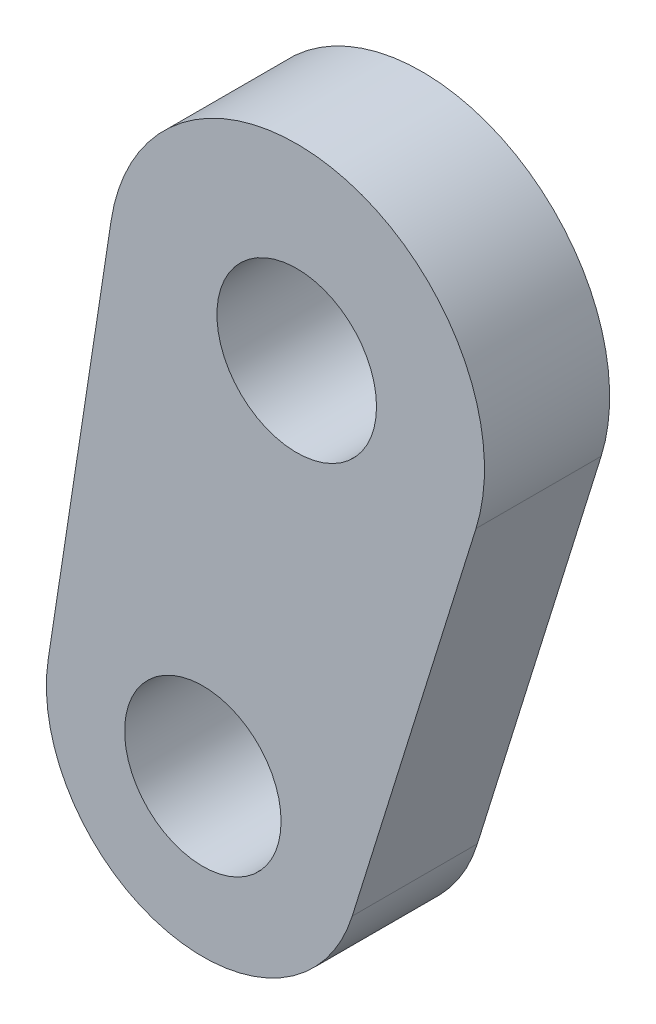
ISO-10303-21;
HEADER;
FILE_DESCRIPTION(('STEP AP214'),'2;1');
FILE_NAME('part.step','',(''),(''),'','','');
FILE_SCHEMA(('AUTOMOTIVE_DESIGN { 1 0 10303 214 1 1 1 1 }'));
ENDSEC;
DATA;
#1=APPLICATION_CONTEXT('core data for automotive mechanical design processes');
#2=APPLICATION_PROTOCOL_DEFINITION('international standard','automotive_design',2000,#1);
#3=PRODUCT_CONTEXT('',#1,'mechanical');
#4=PRODUCT('Part','Part','',(#3));
#5=PRODUCT_RELATED_PRODUCT_CATEGORY('part','',(#4));
#6=PRODUCT_DEFINITION_FORMATION('','',#4);
#7=PRODUCT_DEFINITION_CONTEXT('part definition',#1,'design');
#8=PRODUCT_DEFINITION('design','',#6,#7);
#9=PRODUCT_DEFINITION_SHAPE('','',#8);
#10=(LENGTH_UNIT() NAMED_UNIT(*) SI_UNIT(.MILLI.,.METRE.));
#11=(NAMED_UNIT(*) PLANE_ANGLE_UNIT() SI_UNIT($,.RADIAN.));
#12=(NAMED_UNIT(*) SI_UNIT($,.STERADIAN.) SOLID_ANGLE_UNIT());
#13=UNCERTAINTY_MEASURE_WITH_UNIT(LENGTH_MEASURE(1.E-05),#10,'distance_accuracy_value','');
#14=(GEOMETRIC_REPRESENTATION_CONTEXT(3) GLOBAL_UNCERTAINTY_ASSIGNED_CONTEXT((#13)) GLOBAL_UNIT_ASSIGNED_CONTEXT((#10,
#11,#12)) REPRESENTATION_CONTEXT('',''));
#15=CARTESIAN_POINT('',(0.,0.,0.));
#16=DIRECTION('',(0.,0.,1.));
#17=DIRECTION('',(1.,0.,0.));
#18=AXIS2_PLACEMENT_3D('',#15,#16,#17);
#19=CARTESIAN_POINT('',(-6.,-26.,52.4));
#20=DIRECTION('',(0.,0.,1.));
#21=DIRECTION('',(1.,0.,0.));
#22=AXIS2_PLACEMENT_3D('',#19,#20,#21);
#23=PLANE('',#22);
#24=CARTESIAN_POINT('',(0.,0.,52.4));
#25=DIRECTION('',(0.,0.,1.));
#26=DIRECTION('',(1.,0.,0.));
#27=AXIS2_PLACEMENT_3D('',#24,#25,#26);
#28=CIRCLE('',#27,5.1);
#29=CARTESIAN_POINT('',(5.1,0.,52.4));
#30=VERTEX_POINT('',#29);
#31=EDGE_CURVE('E102',#30,#30,#28,.T.);
#32=ORIENTED_EDGE('',*,*,#31,.F.);
#33=EDGE_LOOP('',(#32));
#34=FACE_BOUND('',#33,.T.);
#35=CARTESIAN_POINT('',(-6.,-26.,52.4));
#36=DIRECTION('',(0.,0.,1.));
#37=DIRECTION('',(1.,0.,0.));
#38=AXIS2_PLACEMENT_3D('',#35,#36,#37);
#39=CIRCLE('',#38,10.);
#40=CARTESIAN_POINT('',(-15.8850421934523,-24.4880671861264,52.4));
#41=VERTEX_POINT('',#40);
#42=CARTESIAN_POINT('',(3.5479635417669,-28.972606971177,52.4));
#43=VERTEX_POINT('',#42);
#44=EDGE_CURVE('E87',#41,#43,#39,.T.);
#45=ORIENTED_EDGE('',*,*,#44,.T.);
#46=DIRECTION('',(0.297260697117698,0.95479635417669,0.));
#47=VECTOR('',#46,1.);
#48=CARTESIAN_POINT('',(3.5479635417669,-28.972606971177,52.4));
#49=LINE('',#48,#47);
#50=CARTESIAN_POINT('',(11.4575562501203,-3.56712836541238,52.4));
#51=VERTEX_POINT('',#50);
#52=EDGE_CURVE('E82',#43,#51,#49,.T.);
#53=ORIENTED_EDGE('',*,*,#52,.T.);
#54=CARTESIAN_POINT('',(0.,0.,52.4));
#55=DIRECTION('',(0.,0.,1.));
#56=DIRECTION('',(1.,0.,0.));
#57=AXIS2_PLACEMENT_3D('',#54,#55,#56);
#58=CIRCLE('',#57,12.);
#59=CARTESIAN_POINT('',(-11.8620506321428,1.81431937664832,52.4));
#60=VERTEX_POINT('',#59);
#61=EDGE_CURVE('E85',#51,#60,#58,.T.);
#62=ORIENTED_EDGE('',*,*,#61,.T.);
#63=DIRECTION('',(-0.151193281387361,-0.98850421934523,0.));
#64=VECTOR('',#63,1.);
#65=CARTESIAN_POINT('',(-11.8620506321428,1.81431937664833,52.4));
#66=LINE('',#65,#64);
#67=EDGE_CURVE('E52',#60,#41,#66,.T.);
#68=ORIENTED_EDGE('',*,*,#67,.T.);
#69=EDGE_LOOP('',(#45,#53,#62,#68));
#70=FACE_BOUND('',#69,.T.);
#71=CARTESIAN_POINT('',(-6.,-26.,52.4));
#72=DIRECTION('',(0.,0.,1.));
#73=DIRECTION('',(1.,0.,0.));
#74=AXIS2_PLACEMENT_3D('',#71,#72,#73);
#75=CIRCLE('',#74,5.);
#76=CARTESIAN_POINT('',(-1.,-26.,52.4));
#77=VERTEX_POINT('',#76);
#78=EDGE_CURVE('E117',#77,#77,#75,.T.);
#79=ORIENTED_EDGE('',*,*,#78,.F.);
#80=EDGE_LOOP('',(#79));
#81=FACE_BOUND('',#80,.T.);
#82=ADVANCED_FACE('F35',(#34,#70,#81),#23,.T.);
#83=CARTESIAN_POINT('',(-6.,-26.,44.4));
#84=DIRECTION('',(0.,0.,1.));
#85=DIRECTION('',(1.,0.,0.));
#86=AXIS2_PLACEMENT_3D('',#83,#84,#85);
#87=PLANE('',#86);
#88=CARTESIAN_POINT('',(-6.,-26.,44.4));
#89=DIRECTION('',(0.,0.,1.));
#90=DIRECTION('',(1.,0.,0.));
#91=AXIS2_PLACEMENT_3D('',#88,#89,#90);
#92=CIRCLE('',#91,10.);
#93=CARTESIAN_POINT('',(-15.8850421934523,-24.4880671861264,44.4));
#94=VERTEX_POINT('',#93);
#95=CARTESIAN_POINT('',(3.5479635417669,-28.972606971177,44.4));
#96=VERTEX_POINT('',#95);
#97=EDGE_CURVE('E99',#94,#96,#92,.T.);
#98=ORIENTED_EDGE('',*,*,#97,.F.);
#99=DIRECTION('',(-0.151193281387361,-0.98850421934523,0.));
#100=VECTOR('',#99,1.);
#101=CARTESIAN_POINT('',(-11.8620506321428,1.81431937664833,44.4));
#102=LINE('',#101,#100);
#103=CARTESIAN_POINT('',(-11.8620506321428,1.81431937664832,44.4));
#104=VERTEX_POINT('',#103);
#105=EDGE_CURVE('E75',#104,#94,#102,.T.);
#106=ORIENTED_EDGE('',*,*,#105,.F.);
#107=CARTESIAN_POINT('',(0.,0.,44.4));
#108=DIRECTION('',(0.,0.,1.));
#109=DIRECTION('',(1.,0.,0.));
#110=AXIS2_PLACEMENT_3D('',#107,#108,#109);
#111=CIRCLE('',#110,12.);
#112=CARTESIAN_POINT('',(11.4575562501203,-3.56712836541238,44.4));
#113=VERTEX_POINT('',#112);
#114=EDGE_CURVE('E69',#113,#104,#111,.T.);
#115=ORIENTED_EDGE('',*,*,#114,.F.);
#116=DIRECTION('',(0.297260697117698,0.95479635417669,0.));
#117=VECTOR('',#116,1.);
#118=CARTESIAN_POINT('',(3.5479635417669,-28.972606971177,44.4));
#119=LINE('',#118,#117);
#120=EDGE_CURVE('E91',#96,#113,#119,.T.);
#121=ORIENTED_EDGE('',*,*,#120,.F.);
#122=EDGE_LOOP('',(#98,#106,#115,#121));
#123=FACE_BOUND('',#122,.T.);
#124=CARTESIAN_POINT('',(0.,0.,44.4));
#125=DIRECTION('',(0.,0.,1.));
#126=DIRECTION('',(1.,0.,0.));
#127=AXIS2_PLACEMENT_3D('',#124,#125,#126);
#128=CIRCLE('',#127,5.1);
#129=CARTESIAN_POINT('',(5.1,0.,44.4));
#130=VERTEX_POINT('',#129);
#131=EDGE_CURVE('E114',#130,#130,#128,.T.);
#132=ORIENTED_EDGE('',*,*,#131,.T.);
#133=EDGE_LOOP('',(#132));
#134=FACE_BOUND('',#133,.T.);
#135=CARTESIAN_POINT('',(-6.,-26.,44.4));
#136=DIRECTION('',(0.,0.,1.));
#137=DIRECTION('',(1.,0.,0.));
#138=AXIS2_PLACEMENT_3D('',#135,#136,#137);
#139=CIRCLE('',#138,5.);
#140=CARTESIAN_POINT('',(-1.,-26.,44.4));
#141=VERTEX_POINT('',#140);
#142=EDGE_CURVE('E120',#141,#141,#139,.T.);
#143=ORIENTED_EDGE('',*,*,#142,.T.);
#144=EDGE_LOOP('',(#143));
#145=FACE_BOUND('',#144,.T.);
#146=ADVANCED_FACE('F110',(#123,#134,#145),#87,.F.);
#147=CARTESIAN_POINT('',(-6.,-26.,52.4));
#148=DIRECTION('',(0.,0.,-1.));
#149=DIRECTION('',(-1.,0.,0.));
#150=AXIS2_PLACEMENT_3D('',#147,#148,#149);
#151=CYLINDRICAL_SURFACE('',#150,10.);
#152=ORIENTED_EDGE('',*,*,#97,.T.);
#153=DIRECTION('',(0.,0.,-1.));
#154=VECTOR('',#153,1.);
#155=CARTESIAN_POINT('',(3.5479635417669,-28.972606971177,52.4));
#156=LINE('',#155,#154);
#157=EDGE_CURVE('E11',#43,#96,#156,.T.);
#158=ORIENTED_EDGE('',*,*,#157,.F.);
#159=ORIENTED_EDGE('',*,*,#44,.F.);
#160=DIRECTION('',(0.,0.,-1.));
#161=VECTOR('',#160,1.);
#162=CARTESIAN_POINT('',(-15.8850421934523,-24.4880671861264,52.4));
#163=LINE('',#162,#161);
#164=EDGE_CURVE('E95',#41,#94,#163,.T.);
#165=ORIENTED_EDGE('',*,*,#164,.T.);
#166=EDGE_LOOP('',(#152,#158,#159,#165));
#167=FACE_BOUND('',#166,.T.);
#168=ADVANCED_FACE('F37',(#167),#151,.T.);
#169=CARTESIAN_POINT('',(3.5479635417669,-28.972606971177,52.4));
#170=DIRECTION('',(-0.954796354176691,0.297260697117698,0.));
#171=DIRECTION('',(-0.297260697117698,-0.954796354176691,0.));
#172=AXIS2_PLACEMENT_3D('',#169,#170,#171);
#173=PLANE('',#172);
#174=ORIENTED_EDGE('',*,*,#120,.T.);
#175=DIRECTION('',(0.,0.,-1.));
#176=VECTOR('',#175,1.);
#177=CARTESIAN_POINT('',(11.4575562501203,-3.56712836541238,52.4));
#178=LINE('',#177,#176);
#179=EDGE_CURVE('E44',#51,#113,#178,.T.);
#180=ORIENTED_EDGE('',*,*,#179,.F.);
#181=ORIENTED_EDGE('',*,*,#52,.F.);
#182=ORIENTED_EDGE('',*,*,#157,.T.);
#183=EDGE_LOOP('',(#174,#180,#181,#182));
#184=FACE_BOUND('',#183,.T.);
#185=ADVANCED_FACE('F90',(#184),#173,.F.);
#186=CARTESIAN_POINT('',(0.,0.,52.4));
#187=DIRECTION('',(0.,0.,-1.));
#188=DIRECTION('',(-1.,0.,0.));
#189=AXIS2_PLACEMENT_3D('',#186,#187,#188);
#190=CYLINDRICAL_SURFACE('',#189,12.);
#191=ORIENTED_EDGE('',*,*,#114,.T.);
#192=DIRECTION('',(0.,0.,-1.));
#193=VECTOR('',#192,1.);
#194=CARTESIAN_POINT('',(-11.8620506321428,1.81431937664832,52.4));
#195=LINE('',#194,#193);
#196=EDGE_CURVE('E92',#60,#104,#195,.T.);
#197=ORIENTED_EDGE('',*,*,#196,.F.);
#198=ORIENTED_EDGE('',*,*,#61,.F.);
#199=ORIENTED_EDGE('',*,*,#179,.T.);
#200=EDGE_LOOP('',(#191,#197,#198,#199));
#201=FACE_BOUND('',#200,.T.);
#202=ADVANCED_FACE('F93',(#201),#190,.T.);
#203=CARTESIAN_POINT('',(-11.8620506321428,1.81431937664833,52.4));
#204=DIRECTION('',(0.98850421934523,-0.151193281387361,0.));
#205=DIRECTION('',(0.151193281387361,0.98850421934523,0.));
#206=AXIS2_PLACEMENT_3D('',#203,#204,#205);
#207=PLANE('',#206);
#208=ORIENTED_EDGE('',*,*,#105,.T.);
#209=ORIENTED_EDGE('',*,*,#164,.F.);
#210=ORIENTED_EDGE('',*,*,#67,.F.);
#211=ORIENTED_EDGE('',*,*,#196,.T.);
#212=EDGE_LOOP('',(#208,#209,#210,#211));
#213=FACE_BOUND('',#212,.T.);
#214=ADVANCED_FACE('F107',(#213),#207,.F.);
#215=CARTESIAN_POINT('',(0.,0.,52.4));
#216=DIRECTION('',(0.,0.,-1.));
#217=DIRECTION('',(-1.,0.,0.));
#218=AXIS2_PLACEMENT_3D('',#215,#216,#217);
#219=CYLINDRICAL_SURFACE('',#218,5.1);
#220=ORIENTED_EDGE('',*,*,#31,.T.);
#221=EDGE_LOOP('',(#220));
#222=FACE_BOUND('',#221,.T.);
#223=ORIENTED_EDGE('',*,*,#131,.F.);
#224=EDGE_LOOP('',(#223));
#225=FACE_BOUND('',#224,.T.);
#226=ADVANCED_FACE('F137',(#222,#225),#219,.F.);
#227=CARTESIAN_POINT('',(-6.,-26.,52.4));
#228=DIRECTION('',(0.,0.,-1.));
#229=DIRECTION('',(-1.,0.,0.));
#230=AXIS2_PLACEMENT_3D('',#227,#228,#229);
#231=CYLINDRICAL_SURFACE('',#230,5.);
#232=ORIENTED_EDGE('',*,*,#78,.T.);
#233=EDGE_LOOP('',(#232));
#234=FACE_BOUND('',#233,.T.);
#235=ORIENTED_EDGE('',*,*,#142,.F.);
#236=EDGE_LOOP('',(#235));
#237=FACE_BOUND('',#236,.T.);
#238=ADVANCED_FACE('F126',(#234,#237),#231,.F.);
#239=CLOSED_SHELL('',(#82,#146,#168,#185,#202,#214,#226,#238));
#240=MANIFOLD_SOLID_BREP('B2',#239);
#241=ADVANCED_BREP_SHAPE_REPRESENTATION('',(#18,#240),#14);
#242=SHAPE_DEFINITION_REPRESENTATION(#9,#241);
ENDSEC;
END-ISO-10303-21;
